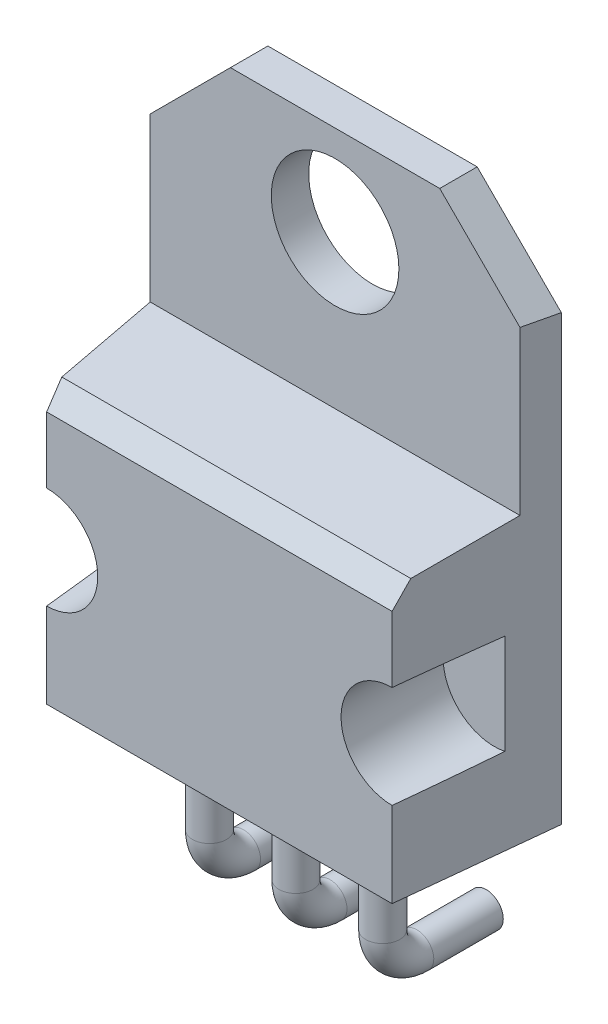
ISO-10303-21;
HEADER;
FILE_DESCRIPTION(('STEP AP214'),'2;1');
FILE_NAME('part.step','',(''),(''),'','','');
FILE_SCHEMA(('AUTOMOTIVE_DESIGN { 1 0 10303 214 1 1 1 1 }'));
ENDSEC;
DATA;
#1=APPLICATION_CONTEXT('core data for automotive mechanical design processes');
#2=APPLICATION_PROTOCOL_DEFINITION('international standard','automotive_design',2000,#1);
#3=PRODUCT_CONTEXT('',#1,'mechanical');
#4=PRODUCT('Part','Part','',(#3));
#5=PRODUCT_RELATED_PRODUCT_CATEGORY('part','',(#4));
#6=PRODUCT_DEFINITION_FORMATION('','',#4);
#7=PRODUCT_DEFINITION_CONTEXT('part definition',#1,'design');
#8=PRODUCT_DEFINITION('design','',#6,#7);
#9=PRODUCT_DEFINITION_SHAPE('','',#8);
#10=(LENGTH_UNIT() NAMED_UNIT(*) SI_UNIT(.MILLI.,.METRE.));
#11=(NAMED_UNIT(*) PLANE_ANGLE_UNIT() SI_UNIT($,.RADIAN.));
#12=(NAMED_UNIT(*) SI_UNIT($,.STERADIAN.) SOLID_ANGLE_UNIT());
#13=UNCERTAINTY_MEASURE_WITH_UNIT(LENGTH_MEASURE(1.E-05),#10,'distance_accuracy_value','');
#14=(GEOMETRIC_REPRESENTATION_CONTEXT(3) GLOBAL_UNCERTAINTY_ASSIGNED_CONTEXT((#13)) GLOBAL_UNIT_ASSIGNED_CONTEXT((#10,
#11,#12)) REPRESENTATION_CONTEXT('',''));
#15=CARTESIAN_POINT('',(0.,0.,0.));
#16=DIRECTION('',(0.,0.,1.));
#17=DIRECTION('',(1.,0.,0.));
#18=AXIS2_PLACEMENT_3D('',#15,#16,#17);
#19=CARTESIAN_POINT('',(0.,0.,1.1));
#20=DIRECTION('',(0.,1.,0.));
#21=DIRECTION('',(0.,0.,1.));
#22=AXIS2_PLACEMENT_3D('',#19,#20,#21);
#23=PLANE('',#22);
#24=CARTESIAN_POINT('',(7.625,0.,2.25));
#25=DIRECTION('',(0.,1.,0.));
#26=DIRECTION('',(0.,0.,-1.));
#27=AXIS2_PLACEMENT_3D('',#24,#25,#26);
#28=CIRCLE('',#27,0.5);
#29=CARTESIAN_POINT('',(7.625,0.,1.75));
#30=VERTEX_POINT('',#29);
#31=EDGE_CURVE('E501',#30,#30,#28,.T.);
#32=ORIENTED_EDGE('',*,*,#31,.T.);
#33=EDGE_LOOP('',(#32));
#34=FACE_BOUND('',#33,.T.);
#35=CARTESIAN_POINT('',(2.535,0.,2.25));
#36=DIRECTION('',(0.,-1.,0.));
#37=DIRECTION('',(0.,0.,-1.));
#38=AXIS2_PLACEMENT_3D('',#35,#36,#37);
#39=CIRCLE('',#38,0.5);
#40=CARTESIAN_POINT('',(2.535,0.,1.75));
#41=VERTEX_POINT('',#40);
#42=EDGE_CURVE('E41',#41,#41,#39,.T.);
#43=ORIENTED_EDGE('',*,*,#42,.F.);
#44=EDGE_LOOP('',(#43));
#45=FACE_BOUND('',#44,.T.);
#46=DIRECTION('',(1.,0.,0.));
#47=VECTOR('',#46,1.);
#48=CARTESIAN_POINT('',(0.,0.,0.));
#49=LINE('',#48,#47);
#50=CARTESIAN_POINT('',(-0.472969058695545,0.,0.));
#51=VERTEX_POINT('',#50);
#52=CARTESIAN_POINT('',(10.6229690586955,0.,0.));
#53=VERTEX_POINT('',#52);
#54=EDGE_CURVE('E172',#51,#53,#49,.T.);
#55=ORIENTED_EDGE('',*,*,#54,.T.);
#56=DIRECTION('',(-0.104528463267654,0.,0.994521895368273));
#57=VECTOR('',#56,1.);
#58=CARTESIAN_POINT('',(10.15,0.,4.5));
#59=LINE('',#58,#57);
#60=CARTESIAN_POINT('',(10.15,0.,4.5));
#61=VERTEX_POINT('',#60);
#62=EDGE_CURVE('E182',#61,#53,#59,.F.);
#63=ORIENTED_EDGE('',*,*,#62,.F.);
#64=DIRECTION('',(1.,0.,0.));
#65=VECTOR('',#64,1.);
#66=CARTESIAN_POINT('',(0.,0.,4.5));
#67=LINE('',#66,#65);
#68=CARTESIAN_POINT('',(0.,0.,4.5));
#69=VERTEX_POINT('',#68);
#70=EDGE_CURVE('E155',#69,#61,#67,.T.);
#71=ORIENTED_EDGE('',*,*,#70,.F.);
#72=DIRECTION('',(0.104528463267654,0.,0.994521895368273));
#73=VECTOR('',#72,1.);
#74=CARTESIAN_POINT('',(-0.353449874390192,0.,1.13714907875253));
#75=LINE('',#74,#73);
#76=EDGE_CURVE('E187',#69,#51,#75,.F.);
#77=ORIENTED_EDGE('',*,*,#76,.T.);
#78=EDGE_LOOP('',(#55,#63,#71,#77));
#79=FACE_BOUND('',#78,.T.);
#80=CARTESIAN_POINT('',(5.07499999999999,0.,2.25));
#81=DIRECTION('',(0.,-1.,0.));
#82=DIRECTION('',(0.,0.,-1.));
#83=AXIS2_PLACEMENT_3D('',#80,#81,#82);
#84=CIRCLE('',#83,0.500000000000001);
#85=CARTESIAN_POINT('',(5.07499999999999,0.,1.75));
#86=VERTEX_POINT('',#85);
#87=EDGE_CURVE('E11',#86,#86,#84,.T.);
#88=ORIENTED_EDGE('',*,*,#87,.F.);
#89=EDGE_LOOP('',(#88));
#90=FACE_BOUND('',#89,.T.);
#91=ADVANCED_FACE('F32',(#34,#45,#79,#90),#23,.F.);
#92=CARTESIAN_POINT('',(0.,15.5,1.1));
#93=DIRECTION('',(0.,0.,-1.));
#94=DIRECTION('',(-1.,0.,0.));
#95=AXIS2_PLACEMENT_3D('',#92,#93,#94);
#96=PLANE('',#95);
#97=CARTESIAN_POINT('',(5.075,12.85,1.1));
#98=DIRECTION('',(0.,0.,1.));
#99=DIRECTION('',(1.,0.,0.));
#100=AXIS2_PLACEMENT_3D('',#97,#98,#99);
#101=CIRCLE('',#100,1.875);
#102=CARTESIAN_POINT('',(6.94999999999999,12.85,1.1));
#103=VERTEX_POINT('',#102);
#104=EDGE_CURVE('E165',#103,#103,#101,.T.);
#105=ORIENTED_EDGE('',*,*,#104,.F.);
#106=EDGE_LOOP('',(#105));
#107=FACE_BOUND('',#106,.T.);
#108=DIRECTION('',(1.,0.,0.));
#109=VECTOR('',#108,1.);
#110=CARTESIAN_POINT('',(0.,8.3573543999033,1.1));
#111=LINE('',#110,#109);
#112=CARTESIAN_POINT('',(10.5073543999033,8.3573543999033,1.1));
#113=VERTEX_POINT('',#112);
#114=CARTESIAN_POINT('',(-0.357354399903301,8.3573543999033,1.1));
#115=VERTEX_POINT('',#114);
#116=EDGE_CURVE('E215',#113,#115,#111,.F.);
#117=ORIENTED_EDGE('',*,*,#116,.F.);
#118=DIRECTION('',(0.,-1.,0.));
#119=VECTOR('',#118,1.);
#120=CARTESIAN_POINT('',(10.5073543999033,15.5,1.1));
#121=LINE('',#120,#119);
#122=CARTESIAN_POINT('',(10.5073543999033,13.1426456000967,1.1));
#123=VERTEX_POINT('',#122);
#124=EDGE_CURVE('E183',#113,#123,#121,.F.);
#125=ORIENTED_EDGE('',*,*,#124,.T.);
#126=DIRECTION('',(0.707106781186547,-0.707106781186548,0.));
#127=VECTOR('',#126,1.);
#128=CARTESIAN_POINT('',(8.15,15.5,1.1));
#129=LINE('',#128,#127);
#130=CARTESIAN_POINT('',(8.14999999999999,15.5,1.1));
#131=VERTEX_POINT('',#130);
#132=EDGE_CURVE('E197',#123,#131,#129,.F.);
#133=ORIENTED_EDGE('',*,*,#132,.T.);
#134=DIRECTION('',(-1.,0.,0.));
#135=VECTOR('',#134,1.);
#136=CARTESIAN_POINT('',(0.,15.5,1.1));
#137=LINE('',#136,#135);
#138=CARTESIAN_POINT('',(2.00000000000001,15.5,1.1));
#139=VERTEX_POINT('',#138);
#140=EDGE_CURVE('E179',#131,#139,#137,.T.);
#141=ORIENTED_EDGE('',*,*,#140,.T.);
#142=DIRECTION('',(0.707106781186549,0.707106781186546,0.));
#143=VECTOR('',#142,1.);
#144=CARTESIAN_POINT('',(0.,13.5,1.1));
#145=LINE('',#144,#143);
#146=CARTESIAN_POINT('',(-0.357354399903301,13.1426456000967,1.1));
#147=VERTEX_POINT('',#146);
#148=EDGE_CURVE('E195',#139,#147,#145,.F.);
#149=ORIENTED_EDGE('',*,*,#148,.T.);
#150=DIRECTION('',(0.,1.,0.));
#151=VECTOR('',#150,1.);
#152=CARTESIAN_POINT('',(-0.357354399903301,15.5,1.1));
#153=LINE('',#152,#151);
#154=EDGE_CURVE('E178',#147,#115,#153,.F.);
#155=ORIENTED_EDGE('',*,*,#154,.T.);
#156=EDGE_LOOP('',(#117,#125,#133,#141,#149,#155));
#157=FACE_BOUND('',#156,.T.);
#158=ADVANCED_FACE('F276',(#107,#157),#96,.F.);
#159=CARTESIAN_POINT('',(0.,0.,4.5));
#160=DIRECTION('',(-0.994521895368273,0.,0.104528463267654));
#161=DIRECTION('',(0.104528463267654,0.,0.994521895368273));
#162=AXIS2_PLACEMENT_3D('',#159,#160,#161);
#163=PLANE('',#162);
#164=DIRECTION('',(0.,-1.,0.));
#165=VECTOR('',#164,1.);
#166=CARTESIAN_POINT('',(0.,0.,4.5));
#167=LINE('',#166,#165);
#168=CARTESIAN_POINT('',(0.,7.43819810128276,4.5));
#169=VERTEX_POINT('',#168);
#170=CARTESIAN_POINT('',(0.,5.5,4.5));
#171=VERTEX_POINT('',#170);
#172=EDGE_CURVE('E221',#169,#171,#167,.T.);
#173=ORIENTED_EDGE('',*,*,#172,.F.);
#174=DIRECTION('',(0.066000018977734,-0.775451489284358,0.627948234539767));
#175=VECTOR('',#174,1.);
#176=CARTESIAN_POINT('',(0.,7.43819810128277,4.5));
#177=LINE('',#176,#175);
#178=CARTESIAN_POINT('',(-0.0522642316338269,8.05226423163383,4.00273905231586));
#179=VERTEX_POINT('',#178);
#180=EDGE_CURVE('E57',#169,#179,#177,.F.);
#181=ORIENTED_EDGE('',*,*,#180,.T.);
#182=DIRECTION('',(-0.103962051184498,0.103962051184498,-0.989132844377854));
#183=VECTOR('',#182,1.);
#184=CARTESIAN_POINT('',(0.0864648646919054,7.9135351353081,5.32265823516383));
#185=LINE('',#184,#183);
#186=EDGE_CURVE('E156',#179,#115,#185,.T.);
#187=ORIENTED_EDGE('',*,*,#186,.T.);
#188=ORIENTED_EDGE('',*,*,#154,.F.);
#189=DIRECTION('',(-0.103962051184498,-0.103962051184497,-0.989132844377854));
#190=VECTOR('',#189,1.);
#191=CARTESIAN_POINT('',(-0.349629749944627,13.1503702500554,1.17349513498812));
#192=LINE('',#191,#190);
#193=CARTESIAN_POINT('',(-0.472969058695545,13.0270309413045,0.));
#194=VERTEX_POINT('',#193);
#195=EDGE_CURVE('E198',#147,#194,#192,.T.);
#196=ORIENTED_EDGE('',*,*,#195,.T.);
#197=DIRECTION('',(0.,1.,0.));
#198=VECTOR('',#197,1.);
#199=CARTESIAN_POINT('',(-0.472969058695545,15.5,0.));
#200=LINE('',#199,#198);
#201=EDGE_CURVE('E171',#194,#51,#200,.F.);
#202=ORIENTED_EDGE('',*,*,#201,.T.);
#203=ORIENTED_EDGE('',*,*,#76,.F.);
#204=DIRECTION('',(0.,1.,0.));
#205=VECTOR('',#204,1.);
#206=CARTESIAN_POINT('',(0.,8.,4.5));
#207=LINE('',#206,#205);
#208=CARTESIAN_POINT('',(0.,2.5,4.5));
#209=VERTEX_POINT('',#208);
#210=EDGE_CURVE('E219',#209,#69,#207,.F.);
#211=ORIENTED_EDGE('',*,*,#210,.F.);
#212=CARTESIAN_POINT('',(0.,4.,4.5));
#213=DIRECTION('',(-0.994521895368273,0.,0.104528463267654));
#214=DIRECTION('',(0.104528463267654,0.,0.994521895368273));
#215=AXIS2_PLACEMENT_3D('',#212,#213,#214);
#216=ELLIPSE('',#215,14.3501583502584,1.5);
#217=CARTESIAN_POINT('',(-0.31531270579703,2.53351512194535,1.5));
#218=VERTEX_POINT('',#217);
#219=EDGE_CURVE('E202',#209,#218,#216,.F.);
#220=ORIENTED_EDGE('',*,*,#219,.T.);
#221=DIRECTION('',(0.,1.,0.));
#222=VECTOR('',#221,1.);
#223=CARTESIAN_POINT('',(-0.31531270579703,0.,1.5));
#224=LINE('',#223,#222);
#225=CARTESIAN_POINT('',(-0.31531270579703,5.46648487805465,1.5));
#226=VERTEX_POINT('',#225);
#227=EDGE_CURVE('E206',#226,#218,#224,.F.);
#228=ORIENTED_EDGE('',*,*,#227,.F.);
#229=CARTESIAN_POINT('',(0.,4.,4.5));
#230=DIRECTION('',(-0.994521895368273,0.,0.104528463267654));
#231=DIRECTION('',(0.104528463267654,0.,0.994521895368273));
#232=AXIS2_PLACEMENT_3D('',#229,#230,#231);
#233=ELLIPSE('',#232,14.3501583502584,1.5);
#234=EDGE_CURVE('E212',#226,#171,#233,.F.);
#235=ORIENTED_EDGE('',*,*,#234,.T.);
#236=EDGE_LOOP('',(#173,#181,#187,#188,#196,#202,#203,#211,#220,#228,#235));
#237=FACE_BOUND('',#236,.T.);
#238=ADVANCED_FACE('F34',(#237),#163,.T.);
#239=CARTESIAN_POINT('',(10.15,0.,4.5));
#240=DIRECTION('',(0.994521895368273,0.,0.104528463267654));
#241=DIRECTION('',(0.104528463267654,0.,-0.994521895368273));
#242=AXIS2_PLACEMENT_3D('',#239,#240,#241);
#243=PLANE('',#242);
#244=DIRECTION('',(0.103962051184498,0.103962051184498,-0.989132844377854));
#245=VECTOR('',#244,1.);
#246=CARTESIAN_POINT('',(10.0402977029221,7.89029770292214,5.54374763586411));
#247=LINE('',#246,#245);
#248=CARTESIAN_POINT('',(10.2022642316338,8.05226423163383,4.00273905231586));
#249=VERTEX_POINT('',#248);
#250=EDGE_CURVE('E159',#249,#113,#247,.T.);
#251=ORIENTED_EDGE('',*,*,#250,.F.);
#252=DIRECTION('',(0.0660000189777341,0.775451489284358,-0.627948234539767));
#253=VECTOR('',#252,1.);
#254=CARTESIAN_POINT('',(10.1057865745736,6.9187229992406,4.92066264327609));
#255=LINE('',#254,#253);
#256=CARTESIAN_POINT('',(10.15,7.43819810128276,4.5));
#257=VERTEX_POINT('',#256);
#258=EDGE_CURVE('E36',#249,#257,#255,.F.);
#259=ORIENTED_EDGE('',*,*,#258,.T.);
#260=DIRECTION('',(0.,-1.,0.));
#261=VECTOR('',#260,1.);
#262=CARTESIAN_POINT('',(10.15,8.,4.5));
#263=LINE('',#262,#261);
#264=CARTESIAN_POINT('',(10.15,5.5,4.5));
#265=VERTEX_POINT('',#264);
#266=EDGE_CURVE('E157',#265,#257,#263,.F.);
#267=ORIENTED_EDGE('',*,*,#266,.F.);
#268=CARTESIAN_POINT('',(10.15,4.,4.49999999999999));
#269=DIRECTION('',(0.994521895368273,0.,0.104528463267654));
#270=DIRECTION('',(-0.104528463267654,0.,0.994521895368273));
#271=AXIS2_PLACEMENT_3D('',#268,#269,#270);
#272=ELLIPSE('',#271,14.3501583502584,1.5);
#273=CARTESIAN_POINT('',(10.465312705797,5.46648487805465,1.5));
#274=VERTEX_POINT('',#273);
#275=EDGE_CURVE('E135',#265,#274,#272,.F.);
#276=ORIENTED_EDGE('',*,*,#275,.T.);
#277=DIRECTION('',(0.,-1.,0.));
#278=VECTOR('',#277,1.);
#279=CARTESIAN_POINT('',(10.465312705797,0.,1.5));
#280=LINE('',#279,#278);
#281=CARTESIAN_POINT('',(10.465312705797,2.53351512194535,1.5));
#282=VERTEX_POINT('',#281);
#283=EDGE_CURVE('E149',#282,#274,#280,.F.);
#284=ORIENTED_EDGE('',*,*,#283,.F.);
#285=CARTESIAN_POINT('',(10.15,4.,4.49999999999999));
#286=DIRECTION('',(0.994521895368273,0.,0.104528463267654));
#287=DIRECTION('',(-0.104528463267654,0.,0.994521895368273));
#288=AXIS2_PLACEMENT_3D('',#285,#286,#287);
#289=ELLIPSE('',#288,14.3501583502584,1.5);
#290=CARTESIAN_POINT('',(10.15,2.5,4.5));
#291=VERTEX_POINT('',#290);
#292=EDGE_CURVE('E132',#282,#291,#289,.F.);
#293=ORIENTED_EDGE('',*,*,#292,.T.);
#294=DIRECTION('',(0.,1.,0.));
#295=VECTOR('',#294,1.);
#296=CARTESIAN_POINT('',(10.15,0.,4.5));
#297=LINE('',#296,#295);
#298=EDGE_CURVE('E148',#61,#291,#297,.T.);
#299=ORIENTED_EDGE('',*,*,#298,.F.);
#300=ORIENTED_EDGE('',*,*,#62,.T.);
#301=DIRECTION('',(0.,-1.,0.));
#302=VECTOR('',#301,1.);
#303=CARTESIAN_POINT('',(10.6229690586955,15.5,0.));
#304=LINE('',#303,#302);
#305=CARTESIAN_POINT('',(10.6229690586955,13.0270309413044,0.));
#306=VERTEX_POINT('',#305);
#307=EDGE_CURVE('E174',#53,#306,#304,.F.);
#308=ORIENTED_EDGE('',*,*,#307,.T.);
#309=DIRECTION('',(-0.103962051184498,0.103962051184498,0.989132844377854));
#310=VECTOR('',#309,1.);
#311=CARTESIAN_POINT('',(10.4563973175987,13.1936026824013,1.58482425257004));
#312=LINE('',#311,#310);
#313=EDGE_CURVE('E194',#306,#123,#312,.T.);
#314=ORIENTED_EDGE('',*,*,#313,.T.);
#315=ORIENTED_EDGE('',*,*,#124,.F.);
#316=EDGE_LOOP('',(#251,#259,#267,#276,#284,#293,#299,#300,#308,#314,#315));
#317=FACE_BOUND('',#316,.T.);
#318=ADVANCED_FACE('F146',(#317),#243,.T.);
#319=CARTESIAN_POINT('',(0.,15.5,1.1));
#320=DIRECTION('',(0.,-1.,0.));
#321=DIRECTION('',(0.,0.,-1.));
#322=AXIS2_PLACEMENT_3D('',#319,#320,#321);
#323=PLANE('',#322);
#324=ORIENTED_EDGE('',*,*,#140,.F.);
#325=DIRECTION('',(0.,0.,-1.));
#326=VECTOR('',#325,1.);
#327=CARTESIAN_POINT('',(8.15,15.5,1.1));
#328=LINE('',#327,#326);
#329=CARTESIAN_POINT('',(8.15,15.5,0.));
#330=VERTEX_POINT('',#329);
#331=EDGE_CURVE('E186',#131,#330,#328,.T.);
#332=ORIENTED_EDGE('',*,*,#331,.T.);
#333=DIRECTION('',(-1.,0.,0.));
#334=VECTOR('',#333,1.);
#335=CARTESIAN_POINT('',(0.,15.5,0.));
#336=LINE('',#335,#334);
#337=CARTESIAN_POINT('',(2.00000000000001,15.5,0.));
#338=VERTEX_POINT('',#337);
#339=EDGE_CURVE('E175',#330,#338,#336,.T.);
#340=ORIENTED_EDGE('',*,*,#339,.T.);
#341=DIRECTION('',(0.,0.,1.));
#342=VECTOR('',#341,1.);
#343=CARTESIAN_POINT('',(2.00000000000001,15.5,1.1));
#344=LINE('',#343,#342);
#345=EDGE_CURVE('E184',#338,#139,#344,.T.);
#346=ORIENTED_EDGE('',*,*,#345,.T.);
#347=EDGE_LOOP('',(#324,#332,#340,#346));
#348=FACE_BOUND('',#347,.T.);
#349=ADVANCED_FACE('F288',(#348),#323,.F.);
#350=CARTESIAN_POINT('',(0.,15.5,0.));
#351=DIRECTION('',(0.,0.,-1.));
#352=DIRECTION('',(-1.,0.,0.));
#353=AXIS2_PLACEMENT_3D('',#350,#351,#352);
#354=PLANE('',#353);
#355=CARTESIAN_POINT('',(5.075,12.85,0.));
#356=DIRECTION('',(0.,0.,1.));
#357=DIRECTION('',(1.,0.,0.));
#358=AXIS2_PLACEMENT_3D('',#355,#356,#357);
#359=CIRCLE('',#358,1.875);
#360=CARTESIAN_POINT('',(6.94999999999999,12.85,0.));
#361=VERTEX_POINT('',#360);
#362=EDGE_CURVE('E168',#361,#361,#359,.T.);
#363=ORIENTED_EDGE('',*,*,#362,.T.);
#364=EDGE_LOOP('',(#363));
#365=FACE_BOUND('',#364,.T.);
#366=ORIENTED_EDGE('',*,*,#339,.F.);
#367=DIRECTION('',(-0.707106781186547,0.707106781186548,0.));
#368=VECTOR('',#367,1.);
#369=CARTESIAN_POINT('',(4.07500000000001,19.575,0.));
#370=LINE('',#369,#368);
#371=EDGE_CURVE('E192',#330,#306,#370,.F.);
#372=ORIENTED_EDGE('',*,*,#371,.T.);
#373=ORIENTED_EDGE('',*,*,#307,.F.);
#374=ORIENTED_EDGE('',*,*,#54,.F.);
#375=ORIENTED_EDGE('',*,*,#201,.F.);
#376=DIRECTION('',(-0.707106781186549,-0.707106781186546,0.));
#377=VECTOR('',#376,1.);
#378=CARTESIAN_POINT('',(0.999999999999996,14.5,0.));
#379=LINE('',#378,#377);
#380=EDGE_CURVE('E190',#194,#338,#379,.F.);
#381=ORIENTED_EDGE('',*,*,#380,.T.);
#382=EDGE_LOOP('',(#366,#372,#373,#374,#375,#381));
#383=FACE_BOUND('',#382,.T.);
#384=ADVANCED_FACE('F546',(#365,#383),#354,.T.);
#385=CARTESIAN_POINT('',(5.075,12.85,0.));
#386=DIRECTION('',(0.,0.,1.));
#387=DIRECTION('',(1.,0.,0.));
#388=AXIS2_PLACEMENT_3D('',#385,#386,#387);
#389=CYLINDRICAL_SURFACE('',#388,1.875);
#390=ORIENTED_EDGE('',*,*,#362,.F.);
#391=EDGE_LOOP('',(#390));
#392=FACE_BOUND('',#391,.T.);
#393=ORIENTED_EDGE('',*,*,#104,.T.);
#394=EDGE_LOOP('',(#393));
#395=FACE_BOUND('',#394,.T.);
#396=ADVANCED_FACE('F538',(#392,#395),#389,.F.);
#397=CARTESIAN_POINT('',(8.15,15.5,1.1));
#398=DIRECTION('',(-0.707106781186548,-0.707106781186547,0.));
#399=DIRECTION('',(0.707106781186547,-0.707106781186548,0.));
#400=AXIS2_PLACEMENT_3D('',#397,#398,#399);
#401=PLANE('',#400);
#402=ORIENTED_EDGE('',*,*,#132,.F.);
#403=ORIENTED_EDGE('',*,*,#313,.F.);
#404=ORIENTED_EDGE('',*,*,#371,.F.);
#405=ORIENTED_EDGE('',*,*,#331,.F.);
#406=EDGE_LOOP('',(#402,#403,#404,#405));
#407=FACE_BOUND('',#406,.T.);
#408=ADVANCED_FACE('F295',(#407),#401,.F.);
#409=CARTESIAN_POINT('',(0.,13.5,1.1));
#410=DIRECTION('',(0.707106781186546,-0.707106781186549,0.));
#411=DIRECTION('',(0.707106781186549,0.707106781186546,0.));
#412=AXIS2_PLACEMENT_3D('',#409,#410,#411);
#413=PLANE('',#412);
#414=ORIENTED_EDGE('',*,*,#148,.F.);
#415=ORIENTED_EDGE('',*,*,#345,.F.);
#416=ORIENTED_EDGE('',*,*,#380,.F.);
#417=ORIENTED_EDGE('',*,*,#195,.F.);
#418=EDGE_LOOP('',(#414,#415,#416,#417));
#419=FACE_BOUND('',#418,.T.);
#420=ADVANCED_FACE('F291',(#419),#413,.F.);
#421=CARTESIAN_POINT('',(0.,8.,4.5));
#422=DIRECTION('',(0.,0.994521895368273,0.104528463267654));
#423=DIRECTION('',(0.,-0.104528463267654,0.994521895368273));
#424=AXIS2_PLACEMENT_3D('',#421,#422,#423);
#425=PLANE('',#424);
#426=ORIENTED_EDGE('',*,*,#186,.F.);
#427=DIRECTION('',(-1.,0.,0.));
#428=VECTOR('',#427,1.);
#429=CARTESIAN_POINT('',(0.,8.05226423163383,4.00273905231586));
#430=LINE('',#429,#428);
#431=EDGE_CURVE('E49',#179,#249,#430,.F.);
#432=ORIENTED_EDGE('',*,*,#431,.T.);
#433=ORIENTED_EDGE('',*,*,#250,.T.);
#434=ORIENTED_EDGE('',*,*,#116,.T.);
#435=EDGE_LOOP('',(#426,#432,#433,#434));
#436=FACE_BOUND('',#435,.T.);
#437=ADVANCED_FACE('F272',(#436),#425,.T.);
#438=CARTESIAN_POINT('',(0.,8.,4.5));
#439=DIRECTION('',(0.,0.,-1.));
#440=DIRECTION('',(-1.,0.,0.));
#441=AXIS2_PLACEMENT_3D('',#438,#439,#440);
#442=PLANE('',#441);
#443=ORIENTED_EDGE('',*,*,#266,.T.);
#444=DIRECTION('',(-1.,0.,0.));
#445=VECTOR('',#444,1.);
#446=CARTESIAN_POINT('',(0.,7.43819810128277,4.5));
#447=LINE('',#446,#445);
#448=EDGE_CURVE('E210',#257,#169,#447,.T.);
#449=ORIENTED_EDGE('',*,*,#448,.T.);
#450=ORIENTED_EDGE('',*,*,#172,.T.);
#451=CARTESIAN_POINT('',(0.,4.,4.5));
#452=DIRECTION('',(0.,0.,-1.));
#453=DIRECTION('',(-1.,0.,0.));
#454=AXIS2_PLACEMENT_3D('',#451,#452,#453);
#455=CIRCLE('',#454,1.5);
#456=EDGE_CURVE('E203',#171,#209,#455,.T.);
#457=ORIENTED_EDGE('',*,*,#456,.T.);
#458=ORIENTED_EDGE('',*,*,#210,.T.);
#459=ORIENTED_EDGE('',*,*,#70,.T.);
#460=ORIENTED_EDGE('',*,*,#298,.T.);
#461=CARTESIAN_POINT('',(10.15,4.,4.5));
#462=DIRECTION('',(0.,0.,1.));
#463=DIRECTION('',(1.,0.,0.));
#464=AXIS2_PLACEMENT_3D('',#461,#462,#463);
#465=CIRCLE('',#464,1.5);
#466=EDGE_CURVE('E128',#265,#291,#465,.T.);
#467=ORIENTED_EDGE('',*,*,#466,.F.);
#468=EDGE_LOOP('',(#443,#449,#450,#457,#458,#459,#460,#467));
#469=FACE_BOUND('',#468,.T.);
#470=ADVANCED_FACE('F153',(#469),#442,.F.);
#471=CARTESIAN_POINT('',(0.,4.,1.5));
#472=DIRECTION('',(0.,0.,1.));
#473=DIRECTION('',(1.,0.,0.));
#474=AXIS2_PLACEMENT_3D('',#471,#472,#473);
#475=PLANE('',#474);
#476=ORIENTED_EDGE('',*,*,#227,.T.);
#477=CARTESIAN_POINT('',(0.,4.,1.5));
#478=DIRECTION('',(0.,0.,1.));
#479=DIRECTION('',(1.,0.,0.));
#480=AXIS2_PLACEMENT_3D('',#477,#478,#479);
#481=CIRCLE('',#480,1.5);
#482=EDGE_CURVE('E150',#218,#226,#481,.T.);
#483=ORIENTED_EDGE('',*,*,#482,.T.);
#484=EDGE_LOOP('',(#476,#483));
#485=FACE_BOUND('',#484,.T.);
#486=ADVANCED_FACE('F263',(#485),#475,.T.);
#487=CARTESIAN_POINT('',(0.,4.,1.5));
#488=DIRECTION('',(0.,0.,1.));
#489=DIRECTION('',(1.,0.,0.));
#490=AXIS2_PLACEMENT_3D('',#487,#488,#489);
#491=CYLINDRICAL_SURFACE('',#490,1.5);
#492=ORIENTED_EDGE('',*,*,#482,.F.);
#493=ORIENTED_EDGE('',*,*,#219,.F.);
#494=ORIENTED_EDGE('',*,*,#456,.F.);
#495=ORIENTED_EDGE('',*,*,#234,.F.);
#496=EDGE_LOOP('',(#492,#493,#494,#495));
#497=FACE_BOUND('',#496,.T.);
#498=ADVANCED_FACE('F260',(#497),#491,.F.);
#499=CARTESIAN_POINT('',(10.15,4.,1.5));
#500=DIRECTION('',(0.,0.,1.));
#501=DIRECTION('',(1.,0.,0.));
#502=AXIS2_PLACEMENT_3D('',#499,#500,#501);
#503=PLANE('',#502);
#504=ORIENTED_EDGE('',*,*,#283,.T.);
#505=CARTESIAN_POINT('',(10.15,4.,1.5));
#506=DIRECTION('',(0.,0.,1.));
#507=DIRECTION('',(1.,0.,0.));
#508=AXIS2_PLACEMENT_3D('',#505,#506,#507);
#509=CIRCLE('',#508,1.5);
#510=EDGE_CURVE('E140',#274,#282,#509,.T.);
#511=ORIENTED_EDGE('',*,*,#510,.T.);
#512=EDGE_LOOP('',(#504,#511));
#513=FACE_BOUND('',#512,.T.);
#514=ADVANCED_FACE('F270',(#513),#503,.T.);
#515=CARTESIAN_POINT('',(10.15,4.,1.5));
#516=DIRECTION('',(0.,0.,1.));
#517=DIRECTION('',(1.,0.,0.));
#518=AXIS2_PLACEMENT_3D('',#515,#516,#517);
#519=CYLINDRICAL_SURFACE('',#518,1.5);
#520=ORIENTED_EDGE('',*,*,#510,.F.);
#521=ORIENTED_EDGE('',*,*,#275,.F.);
#522=ORIENTED_EDGE('',*,*,#466,.T.);
#523=ORIENTED_EDGE('',*,*,#292,.F.);
#524=EDGE_LOOP('',(#520,#521,#522,#523));
#525=FACE_BOUND('',#524,.T.);
#526=ADVANCED_FACE('F131',(#525),#519,.F.);
#527=CARTESIAN_POINT('',(0.,7.43819810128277,4.5));
#528=DIRECTION('',(0.,0.62932039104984,0.777145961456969));
#529=DIRECTION('',(0.,-0.777145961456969,0.62932039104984));
#530=AXIS2_PLACEMENT_3D('',#527,#528,#529);
#531=PLANE('',#530);
#532=ORIENTED_EDGE('',*,*,#258,.F.);
#533=ORIENTED_EDGE('',*,*,#431,.F.);
#534=ORIENTED_EDGE('',*,*,#180,.F.);
#535=ORIENTED_EDGE('',*,*,#448,.F.);
#536=EDGE_LOOP('',(#532,#533,#534,#535));
#537=FACE_BOUND('',#536,.T.);
#538=ADVANCED_FACE('F301',(#537),#531,.T.);
#539=CARTESIAN_POINT('',(2.535,-4.05,1.24999999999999));
#540=DIRECTION('',(0.,0.,-1.));
#541=DIRECTION('',(-1.,0.,0.));
#542=AXIS2_PLACEMENT_3D('',#539,#540,#541);
#543=CYLINDRICAL_SURFACE('',#542,0.5);
#544=CARTESIAN_POINT('',(2.535,-4.05,1.24999999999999));
#545=DIRECTION('',(0.,0.,-1.));
#546=DIRECTION('',(0.,1.,0.));
#547=AXIS2_PLACEMENT_3D('',#544,#545,#546);
#548=CIRCLE('',#547,0.5);
#549=CARTESIAN_POINT('',(2.535,-4.55,1.24999999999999));
#550=VERTEX_POINT('',#549);
#551=EDGE_CURVE('E251',#550,#550,#548,.T.);
#552=ORIENTED_EDGE('',*,*,#551,.T.);
#553=EDGE_LOOP('',(#552));
#554=FACE_BOUND('',#553,.T.);
#555=CARTESIAN_POINT('',(2.535,-4.05,-0.791981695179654));
#556=DIRECTION('',(0.,0.,-1.));
#557=DIRECTION('',(0.,1.,0.));
#558=AXIS2_PLACEMENT_3D('',#555,#556,#557);
#559=CIRCLE('',#558,0.5);
#560=CARTESIAN_POINT('',(2.535,-3.55,-0.791981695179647));
#561=VERTEX_POINT('',#560);
#562=EDGE_CURVE('E141',#561,#561,#559,.T.);
#563=ORIENTED_EDGE('',*,*,#562,.F.);
#564=EDGE_LOOP('',(#563));
#565=FACE_BOUND('',#564,.T.);
#566=ADVANCED_FACE('F303',(#554,#565),#543,.T.);
#567=CARTESIAN_POINT('',(2.535,-3.05,1.25));
#568=DIRECTION('',(1.,0.,0.));
#569=DIRECTION('',(0.,0.,-1.));
#570=AXIS2_PLACEMENT_3D('',#567,#568,#569);
#571=TOROIDAL_SURFACE('',#570,0.999999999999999,0.5);
#572=CARTESIAN_POINT('',(2.535,-3.04999999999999,2.25));
#573=DIRECTION('',(0.,-1.,0.));
#574=DIRECTION('',(0.,0.,-1.));
#575=AXIS2_PLACEMENT_3D('',#572,#573,#574);
#576=CIRCLE('',#575,0.5);
#577=CARTESIAN_POINT('',(2.535,-3.04999999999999,2.75));
#578=VERTEX_POINT('',#577);
#579=EDGE_CURVE('E248',#578,#578,#576,.T.);
#580=CARTESIAN_POINT('',(2.535,-3.05,1.25));
#581=DIRECTION('',(1.,0.,0.));
#582=DIRECTION('',(0.,0.,-1.));
#583=AXIS2_PLACEMENT_3D('',#580,#581,#582);
#584=CIRCLE('',#583,1.5);
#585=EDGE_CURVE('',#578,#550,#584,.T.);
#586=ORIENTED_EDGE('',*,*,#579,.T.);
#587=ORIENTED_EDGE('',*,*,#551,.F.);
#588=ORIENTED_EDGE('',*,*,#585,.T.);
#589=ORIENTED_EDGE('',*,*,#585,.F.);
#590=EDGE_LOOP('',(#586,#588,#587,#589));
#591=FACE_BOUND('',#590,.T.);
#592=ADVANCED_FACE('F309',(#591),#571,.T.);
#593=CARTESIAN_POINT('',(2.535,-3.04999999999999,2.25));
#594=DIRECTION('',(0.,1.,0.));
#595=DIRECTION('',(0.,0.,1.));
#596=AXIS2_PLACEMENT_3D('',#593,#594,#595);
#597=CYLINDRICAL_SURFACE('',#596,0.5);
#598=ORIENTED_EDGE('',*,*,#579,.F.);
#599=EDGE_LOOP('',(#598));
#600=FACE_BOUND('',#599,.T.);
#601=ORIENTED_EDGE('',*,*,#42,.T.);
#602=EDGE_LOOP('',(#601));
#603=FACE_BOUND('',#602,.T.);
#604=ADVANCED_FACE('F371',(#600,#603),#597,.T.);
#605=CARTESIAN_POINT('',(2.535,-4.05,-0.791981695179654));
#606=DIRECTION('',(0.,0.,-1.));
#607=DIRECTION('',(0.,1.,0.));
#608=AXIS2_PLACEMENT_3D('',#605,#606,#607);
#609=PLANE('',#608);
#610=ORIENTED_EDGE('',*,*,#562,.T.);
#611=EDGE_LOOP('',(#610));
#612=FACE_BOUND('',#611,.T.);
#613=ADVANCED_FACE('F380',(#612),#609,.T.);
#614=CARTESIAN_POINT('',(5.07499999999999,-4.05,1.24999999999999));
#615=DIRECTION('',(0.,0.,-1.));
#616=DIRECTION('',(-1.,0.,0.));
#617=AXIS2_PLACEMENT_3D('',#614,#615,#616);
#618=CYLINDRICAL_SURFACE('',#617,0.500000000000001);
#619=CARTESIAN_POINT('',(5.07499999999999,-4.05,1.24999999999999));
#620=DIRECTION('',(0.,0.,-1.));
#621=DIRECTION('',(0.,1.,0.));
#622=AXIS2_PLACEMENT_3D('',#619,#620,#621);
#623=CIRCLE('',#622,0.500000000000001);
#624=CARTESIAN_POINT('',(5.07499999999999,-4.55,1.24999999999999));
#625=VERTEX_POINT('',#624);
#626=EDGE_CURVE('E487',#625,#625,#623,.T.);
#627=ORIENTED_EDGE('',*,*,#626,.T.);
#628=EDGE_LOOP('',(#627));
#629=FACE_BOUND('',#628,.T.);
#630=CARTESIAN_POINT('',(5.07499999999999,-4.05,-0.791981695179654));
#631=DIRECTION('',(0.,0.,-1.));
#632=DIRECTION('',(0.,1.,0.));
#633=AXIS2_PLACEMENT_3D('',#630,#631,#632);
#634=CIRCLE('',#633,0.500000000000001);
#635=CARTESIAN_POINT('',(5.07499999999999,-3.55,-0.791981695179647));
#636=VERTEX_POINT('',#635);
#637=EDGE_CURVE('E246',#636,#636,#634,.T.);
#638=ORIENTED_EDGE('',*,*,#637,.F.);
#639=EDGE_LOOP('',(#638));
#640=FACE_BOUND('',#639,.T.);
#641=ADVANCED_FACE('F390',(#629,#640),#618,.T.);
#642=CARTESIAN_POINT('',(5.07499999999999,-3.05,1.25));
#643=DIRECTION('',(1.,0.,0.));
#644=DIRECTION('',(0.,0.,-1.));
#645=AXIS2_PLACEMENT_3D('',#642,#643,#644);
#646=TOROIDAL_SURFACE('',#645,1.,0.500000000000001);
#647=CARTESIAN_POINT('',(5.07499999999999,-3.04999999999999,2.25));
#648=DIRECTION('',(0.,-1.,0.));
#649=DIRECTION('',(0.,0.,-1.));
#650=AXIS2_PLACEMENT_3D('',#647,#648,#649);
#651=CIRCLE('',#650,0.500000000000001);
#652=CARTESIAN_POINT('',(5.07499999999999,-3.04999999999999,2.75));
#653=VERTEX_POINT('',#652);
#654=EDGE_CURVE('E483',#653,#653,#651,.T.);
#655=CARTESIAN_POINT('',(5.07499999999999,-3.05,1.25));
#656=DIRECTION('',(1.,0.,0.));
#657=DIRECTION('',(0.,0.,-1.));
#658=AXIS2_PLACEMENT_3D('',#655,#656,#657);
#659=CIRCLE('',#658,1.5);
#660=EDGE_CURVE('',#653,#625,#659,.T.);
#661=ORIENTED_EDGE('',*,*,#654,.T.);
#662=ORIENTED_EDGE('',*,*,#626,.F.);
#663=ORIENTED_EDGE('',*,*,#660,.T.);
#664=ORIENTED_EDGE('',*,*,#660,.F.);
#665=EDGE_LOOP('',(#661,#663,#662,#664));
#666=FACE_BOUND('',#665,.T.);
#667=ADVANCED_FACE('F401',(#666),#646,.T.);
#668=CARTESIAN_POINT('',(5.07499999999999,-3.04999999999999,2.25));
#669=DIRECTION('',(0.,1.,0.));
#670=DIRECTION('',(0.,0.,1.));
#671=AXIS2_PLACEMENT_3D('',#668,#669,#670);
#672=CYLINDRICAL_SURFACE('',#671,0.500000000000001);
#673=ORIENTED_EDGE('',*,*,#654,.F.);
#674=EDGE_LOOP('',(#673));
#675=FACE_BOUND('',#674,.T.);
#676=ORIENTED_EDGE('',*,*,#87,.T.);
#677=EDGE_LOOP('',(#676));
#678=FACE_BOUND('',#677,.T.);
#679=ADVANCED_FACE('F412',(#675,#678),#672,.T.);
#680=CARTESIAN_POINT('',(5.07499999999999,-4.05,-0.791981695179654));
#681=DIRECTION('',(0.,0.,-1.));
#682=DIRECTION('',(0.,1.,0.));
#683=AXIS2_PLACEMENT_3D('',#680,#681,#682);
#684=PLANE('',#683);
#685=ORIENTED_EDGE('',*,*,#637,.T.);
#686=EDGE_LOOP('',(#685));
#687=FACE_BOUND('',#686,.T.);
#688=ADVANCED_FACE('F422',(#687),#684,.T.);
#689=CARTESIAN_POINT('',(7.625,-4.05,1.24999999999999));
#690=DIRECTION('',(0.,0.,-1.));
#691=DIRECTION('',(-1.,0.,0.));
#692=AXIS2_PLACEMENT_3D('',#689,#690,#691);
#693=CYLINDRICAL_SURFACE('',#692,0.5);
#694=CARTESIAN_POINT('',(7.625,-4.05,1.24999999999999));
#695=DIRECTION('',(0.,0.,1.));
#696=DIRECTION('',(0.,1.,0.));
#697=AXIS2_PLACEMENT_3D('',#694,#695,#696);
#698=CIRCLE('',#697,0.5);
#699=CARTESIAN_POINT('',(7.625,-4.55,1.24999999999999));
#700=VERTEX_POINT('',#699);
#701=EDGE_CURVE('E484',#700,#700,#698,.T.);
#702=ORIENTED_EDGE('',*,*,#701,.F.);
#703=EDGE_LOOP('',(#702));
#704=FACE_BOUND('',#703,.T.);
#705=CARTESIAN_POINT('',(7.625,-4.05,-0.791981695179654));
#706=DIRECTION('',(0.,0.,1.));
#707=DIRECTION('',(0.,1.,0.));
#708=AXIS2_PLACEMENT_3D('',#705,#706,#707);
#709=CIRCLE('',#708,0.5);
#710=CARTESIAN_POINT('',(7.625,-3.55,-0.791981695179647));
#711=VERTEX_POINT('',#710);
#712=EDGE_CURVE('E481',#711,#711,#709,.T.);
#713=ORIENTED_EDGE('',*,*,#712,.T.);
#714=EDGE_LOOP('',(#713));
#715=FACE_BOUND('',#714,.T.);
#716=ADVANCED_FACE('F431',(#704,#715),#693,.T.);
#717=CARTESIAN_POINT('',(7.625,-3.05,1.25));
#718=DIRECTION('',(1.,0.,0.));
#719=DIRECTION('',(0.,0.,-1.));
#720=AXIS2_PLACEMENT_3D('',#717,#718,#719);
#721=TOROIDAL_SURFACE('',#720,0.999999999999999,0.5);
#722=CARTESIAN_POINT('',(7.625,-3.04999999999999,2.25));
#723=DIRECTION('',(0.,1.,0.));
#724=DIRECTION('',(0.,0.,-1.));
#725=AXIS2_PLACEMENT_3D('',#722,#723,#724);
#726=CIRCLE('',#725,0.5);
#727=CARTESIAN_POINT('',(7.625,-3.04999999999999,2.75));
#728=VERTEX_POINT('',#727);
#729=EDGE_CURVE('E490',#728,#728,#726,.T.);
#730=CARTESIAN_POINT('',(7.625,-3.05,1.25));
#731=DIRECTION('',(1.,0.,0.));
#732=DIRECTION('',(0.,0.,-1.));
#733=AXIS2_PLACEMENT_3D('',#730,#731,#732);
#734=CIRCLE('',#733,1.5);
#735=EDGE_CURVE('',#728,#700,#734,.T.);
#736=ORIENTED_EDGE('',*,*,#729,.F.);
#737=ORIENTED_EDGE('',*,*,#701,.T.);
#738=ORIENTED_EDGE('',*,*,#735,.T.);
#739=ORIENTED_EDGE('',*,*,#735,.F.);
#740=EDGE_LOOP('',(#736,#738,#737,#739));
#741=FACE_BOUND('',#740,.T.);
#742=ADVANCED_FACE('F445',(#741),#721,.T.);
#743=CARTESIAN_POINT('',(7.625,-3.04999999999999,2.25));
#744=DIRECTION('',(0.,1.,0.));
#745=DIRECTION('',(0.,0.,1.));
#746=AXIS2_PLACEMENT_3D('',#743,#744,#745);
#747=CYLINDRICAL_SURFACE('',#746,0.5);
#748=ORIENTED_EDGE('',*,*,#729,.T.);
#749=EDGE_LOOP('',(#748));
#750=FACE_BOUND('',#749,.T.);
#751=ORIENTED_EDGE('',*,*,#31,.F.);
#752=EDGE_LOOP('',(#751));
#753=FACE_BOUND('',#752,.T.);
#754=ADVANCED_FACE('F455',(#750,#753),#747,.T.);
#755=CARTESIAN_POINT('',(7.625,-4.05,-0.791981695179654));
#756=DIRECTION('',(0.,0.,-1.));
#757=DIRECTION('',(0.,1.,0.));
#758=AXIS2_PLACEMENT_3D('',#755,#756,#757);
#759=PLANE('',#758);
#760=ORIENTED_EDGE('',*,*,#712,.F.);
#761=EDGE_LOOP('',(#760));
#762=FACE_BOUND('',#761,.T.);
#763=ADVANCED_FACE('F465',(#762),#759,.T.);
#764=CLOSED_SHELL('',(#91,#158,#238,#318,#349,#384,#396,#408,#420,#437,#470,#486,#498,#514,#526,
#538,#566,#592,#604,#613,#641,#667,#679,#688,#716,#742,#754,#763));
#765=MANIFOLD_SOLID_BREP('B2',#764);
#766=ADVANCED_BREP_SHAPE_REPRESENTATION('',(#18,#765),#14);
#767=SHAPE_DEFINITION_REPRESENTATION(#9,#766);
ENDSEC;
END-ISO-10303-21;
